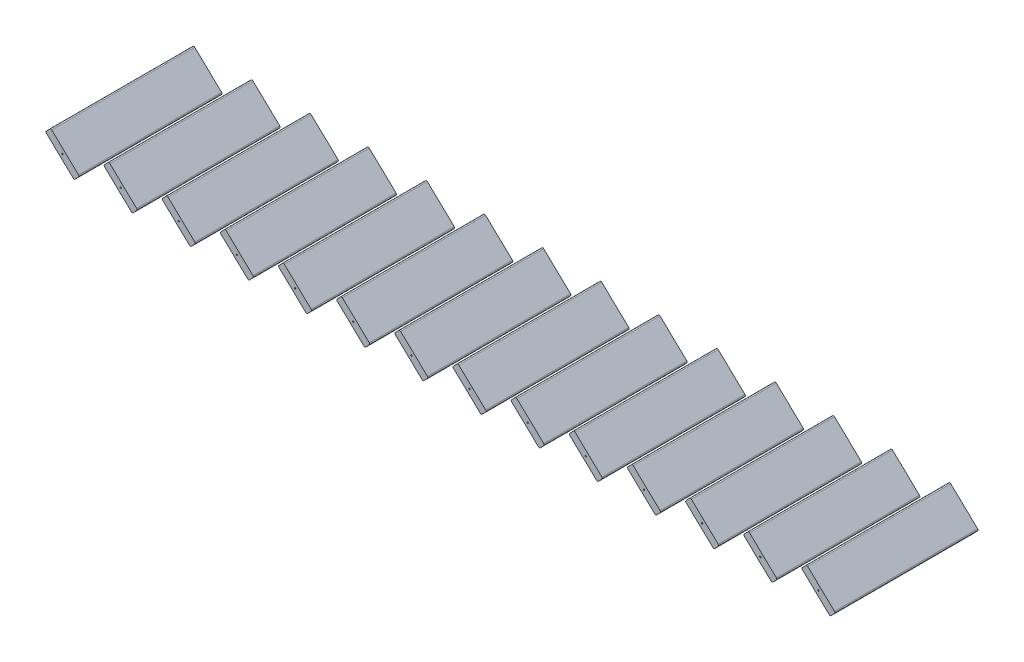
from build123d import *

# Parameters (mm, degrees)
BOSS_EXTRUDE1_DEPTH      = 545
BOSS_EXTRUDE2_START      = -15
BOSS_EXTRUDE2_DEPTH      = 15
M5_CLEARANCE_HOLE2_D     = 5.3
M5_CLEARANCE_HOLE2_DEPTH = 70
M5_CLEARANCE_HOLE2_TIP   = 1.59228064
M5_CLEARANCE_HOLE3_D     = 5.3
M5_CLEARANCE_HOLE3_DEPTH = 70
M5_CLEARANCE_HOLE3_TIP   = 1.59228064
LPATTERN1_COUNT          = 14
LPATTERN1_PITCH          = 227.61


with BuildPart() as part:
    # Sketch1 → Boss-Extrude1 (new body)
    with BuildSketch(Plane.XY):
        with BuildLine():
            ThreePointArc((-2835.622436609, 2.07792202), (-2837.176821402, 5.574856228), (-2835.803231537, 9.146678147))
            Line((-2835.803231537, 9.146678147), (-2822.027309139, 23.64578026))
            ThreePointArc((-2822.027309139, 23.64578026), (-2818.530374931, 25.200165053), (-2814.958553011, 23.826575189))
            Line((-2814.958553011, 23.826575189), (-2709.840062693, -76.048862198))
            ThreePointArc((-2709.840062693, -76.048862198), (-2708.2856779, -79.545796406), (-2709.659267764, -83.117618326))
            Line((-2709.659267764, -83.117618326), (-2723.435190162, -97.616720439))
            ThreePointArc((-2723.435190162, -97.616720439), (-2726.932124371, -99.171105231), (-2730.50394629, -97.797515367))
            Line((-2730.50394629, -97.797515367), (-2835.622436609, 2.07792202))
        make_face()
    extrude(amount=BOSS_EXTRUDE1_DEPTH)

    # Sketch1_11 → Boss-Extrude2 (add)
    with BuildSketch(Plane.XY.offset(BOSS_EXTRUDE2_START)):
        with BuildLine():
            ThreePointArc((-2730.50394629, -97.797515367), (-2726.932124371, -99.171105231), (-2723.435190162, -97.616720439))
            Line((-2723.435190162, -97.616720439), (-2709.659267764, -83.117618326))
            ThreePointArc((-2709.659267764, -83.117618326), (-2708.2856779, -79.545796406), (-2709.840062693, -76.048862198))
            Line((-2709.840062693, -76.048862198), (-2814.958553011, 23.826575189))
            ThreePointArc((-2814.958553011, 23.826575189), (-2818.530374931, 25.200165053), (-2822.027309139, 23.64578026))
            Line((-2822.027309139, 23.64578026), (-2835.803231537, 9.146678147))
            ThreePointArc((-2835.803231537, 9.146678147), (-2837.176821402, 5.574856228), (-2835.622436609, 2.07792202))
            Line((-2835.622436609, 2.07792202), (-2730.50394629, -97.797515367))
        make_face()
    extrude(amount=BOSS_EXTRUDE2_DEPTH)

    # M5 Clearance Hole2
    with Locations(Plane(origin=(0, 0, -15), x_dir=(-1, 0, 0), z_dir=(0, 0, -1))):
        with Locations((2772.731249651, -36.985470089)):
            Hole(M5_CLEARANCE_HOLE2_D / 2, depth=M5_CLEARANCE_HOLE2_DEPTH)
            with Locations((0, 0, -(M5_CLEARANCE_HOLE2_DEPTH + M5_CLEARANCE_HOLE2_TIP / 2))):  # 118° drill point
                Cone(0, M5_CLEARANCE_HOLE2_D / 2, M5_CLEARANCE_HOLE2_TIP, mode=Mode.SUBTRACT)

    # M5 Clearance Hole3
    with Locations(Plane.XY.offset(545)):
        with Locations((-2772.731249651, -36.985470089)):
            Hole(M5_CLEARANCE_HOLE3_D / 2, depth=M5_CLEARANCE_HOLE3_DEPTH)
            with Locations((0, 0, -(M5_CLEARANCE_HOLE3_DEPTH + M5_CLEARANCE_HOLE3_TIP / 2))):  # 118° drill point
                Cone(0, M5_CLEARANCE_HOLE3_D / 2, M5_CLEARANCE_HOLE3_TIP, mode=Mode.SUBTRACT)


with BuildPart() as lpattern1_1:
    # LPattern1: pattern copy
    add(part.part.moved(Location(Vector(1, 0, 0) * (1 * LPATTERN1_PITCH))))


with BuildPart() as lpattern1_2:
    # LPattern1: pattern copy
    add(part.part.moved(Location(Vector(1, 0, 0) * (2 * LPATTERN1_PITCH))))


with BuildPart() as lpattern1_3:
    # LPattern1: pattern copy
    add(part.part.moved(Location(Vector(1, 0, 0) * (3 * LPATTERN1_PITCH))))


with BuildPart() as lpattern1_4:
    # LPattern1: pattern copy
    add(part.part.moved(Location(Vector(1, 0, 0) * (4 * LPATTERN1_PITCH))))


with BuildPart() as lpattern1_5:
    # LPattern1: pattern copy
    add(part.part.moved(Location(Vector(1, 0, 0) * (5 * LPATTERN1_PITCH))))


with BuildPart() as lpattern1_6:
    # LPattern1: pattern copy
    add(part.part.moved(Location(Vector(1, 0, 0) * (6 * LPATTERN1_PITCH))))


with BuildPart() as lpattern1_7:
    # LPattern1: pattern copy
    add(part.part.moved(Location(Vector(1, 0, 0) * (7 * LPATTERN1_PITCH))))


with BuildPart() as lpattern1_8:
    # LPattern1: pattern copy
    add(part.part.moved(Location(Vector(1, 0, 0) * (8 * LPATTERN1_PITCH))))


with BuildPart() as lpattern1_9:
    # LPattern1: pattern copy
    add(part.part.moved(Location(Vector(1, 0, 0) * (9 * LPATTERN1_PITCH))))


with BuildPart() as lpattern1_10:
    # LPattern1: pattern copy
    add(part.part.moved(Location(Vector(1, 0, 0) * (10 * LPATTERN1_PITCH))))


with BuildPart() as lpattern1_11:
    # LPattern1: pattern copy
    add(part.part.moved(Location(Vector(1, 0, 0) * (11 * LPATTERN1_PITCH))))


with BuildPart() as lpattern1_12:
    # LPattern1: pattern copy
    add(part.part.moved(Location(Vector(1, 0, 0) * (12 * LPATTERN1_PITCH))))


with BuildPart() as lpattern1_13:
    # LPattern1: pattern copy
    add(part.part.moved(Location(Vector(1, 0, 0) * (13 * LPATTERN1_PITCH))))


solid = Compound([part.part, lpattern1_1.part, lpattern1_2.part, lpattern1_3.part, lpattern1_4.part, lpattern1_5.part, lpattern1_6.part, lpattern1_7.part, lpattern1_8.part, lpattern1_9.part, lpattern1_10.part, lpattern1_11.part, lpattern1_12.part, lpattern1_13.part])
